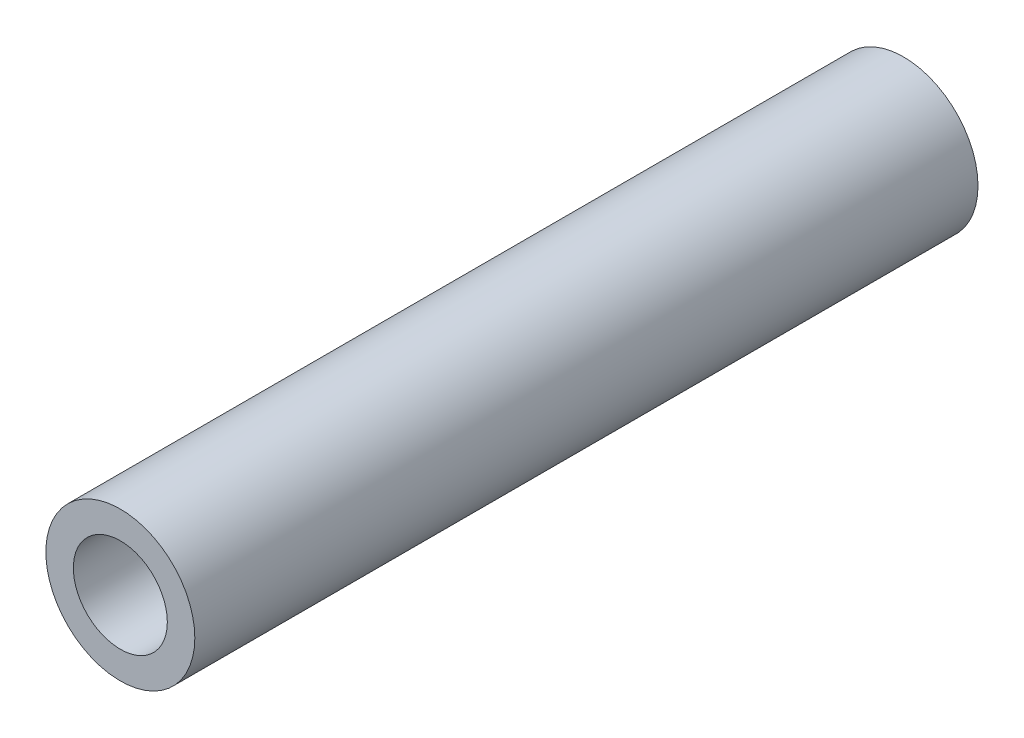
ISO-10303-21;
HEADER;
FILE_DESCRIPTION(('STEP AP214'),'2;1');
FILE_NAME('part.step','',(''),(''),'','','');
FILE_SCHEMA(('AUTOMOTIVE_DESIGN { 1 0 10303 214 1 1 1 1 }'));
ENDSEC;
DATA;
#1=APPLICATION_CONTEXT('core data for automotive mechanical design processes');
#2=APPLICATION_PROTOCOL_DEFINITION('international standard','automotive_design',2000,#1);
#3=PRODUCT_CONTEXT('',#1,'mechanical');
#4=PRODUCT('Part','Part','',(#3));
#5=PRODUCT_RELATED_PRODUCT_CATEGORY('part','',(#4));
#6=PRODUCT_DEFINITION_FORMATION('','',#4);
#7=PRODUCT_DEFINITION_CONTEXT('part definition',#1,'design');
#8=PRODUCT_DEFINITION('design','',#6,#7);
#9=PRODUCT_DEFINITION_SHAPE('','',#8);
#10=(LENGTH_UNIT() NAMED_UNIT(*) SI_UNIT(.MILLI.,.METRE.));
#11=(NAMED_UNIT(*) PLANE_ANGLE_UNIT() SI_UNIT($,.RADIAN.));
#12=(NAMED_UNIT(*) SI_UNIT($,.STERADIAN.) SOLID_ANGLE_UNIT());
#13=UNCERTAINTY_MEASURE_WITH_UNIT(LENGTH_MEASURE(1.E-05),#10,'distance_accuracy_value','');
#14=(GEOMETRIC_REPRESENTATION_CONTEXT(3) GLOBAL_UNCERTAINTY_ASSIGNED_CONTEXT((#13)) GLOBAL_UNIT_ASSIGNED_CONTEXT((#10,
#11,#12)) REPRESENTATION_CONTEXT('',''));
#15=CARTESIAN_POINT('',(0.,0.,0.));
#16=DIRECTION('',(0.,0.,1.));
#17=DIRECTION('',(1.,0.,0.));
#18=AXIS2_PLACEMENT_3D('',#15,#16,#17);
#19=CARTESIAN_POINT('',(0.,0.,250.));
#20=DIRECTION('',(0.,0.,1.));
#21=DIRECTION('',(1.,0.,0.));
#22=AXIS2_PLACEMENT_3D('',#19,#20,#21);
#23=PLANE('',#22);
#24=CARTESIAN_POINT('',(0.,0.,250.));
#25=DIRECTION('',(0.,0.,1.));
#26=DIRECTION('',(1.,0.,0.));
#27=AXIS2_PLACEMENT_3D('',#24,#25,#26);
#28=CIRCLE('',#27,23.775);
#29=CARTESIAN_POINT('',(23.775,0.,250.));
#30=VERTEX_POINT('',#29);
#31=EDGE_CURVE('E10',#30,#30,#28,.T.);
#32=ORIENTED_EDGE('',*,*,#31,.T.);
#33=EDGE_LOOP('',(#32));
#34=FACE_BOUND('',#33,.T.);
#35=CARTESIAN_POINT('',(0.,0.,250.));
#36=DIRECTION('',(0.,0.,1.));
#37=DIRECTION('',(1.,0.,0.));
#38=AXIS2_PLACEMENT_3D('',#35,#36,#37);
#39=CIRCLE('',#38,15.);
#40=CARTESIAN_POINT('',(15.,0.,250.));
#41=VERTEX_POINT('',#40);
#42=EDGE_CURVE('E46',#41,#41,#39,.T.);
#43=ORIENTED_EDGE('',*,*,#42,.F.);
#44=EDGE_LOOP('',(#43));
#45=FACE_BOUND('',#44,.T.);
#46=ADVANCED_FACE('F35',(#34,#45),#23,.T.);
#47=CARTESIAN_POINT('',(0.,0.,0.));
#48=DIRECTION('',(0.,0.,1.));
#49=DIRECTION('',(1.,0.,0.));
#50=AXIS2_PLACEMENT_3D('',#47,#48,#49);
#51=PLANE('',#50);
#52=CARTESIAN_POINT('',(0.,0.,0.));
#53=DIRECTION('',(0.,0.,1.));
#54=DIRECTION('',(1.,0.,0.));
#55=AXIS2_PLACEMENT_3D('',#52,#53,#54);
#56=CIRCLE('',#55,23.775);
#57=CARTESIAN_POINT('',(23.775,0.,0.));
#58=VERTEX_POINT('',#57);
#59=EDGE_CURVE('E39',#58,#58,#56,.T.);
#60=ORIENTED_EDGE('',*,*,#59,.F.);
#61=EDGE_LOOP('',(#60));
#62=FACE_BOUND('',#61,.T.);
#63=CARTESIAN_POINT('',(0.,0.,0.));
#64=DIRECTION('',(0.,0.,1.));
#65=DIRECTION('',(1.,0.,0.));
#66=AXIS2_PLACEMENT_3D('',#63,#64,#65);
#67=CIRCLE('',#66,15.);
#68=CARTESIAN_POINT('',(15.,0.,0.));
#69=VERTEX_POINT('',#68);
#70=EDGE_CURVE('E48',#69,#69,#67,.T.);
#71=ORIENTED_EDGE('',*,*,#70,.T.);
#72=EDGE_LOOP('',(#71));
#73=FACE_BOUND('',#72,.T.);
#74=ADVANCED_FACE('F58',(#62,#73),#51,.F.);
#75=CARTESIAN_POINT('',(0.,0.,250.));
#76=DIRECTION('',(0.,0.,-1.));
#77=DIRECTION('',(-1.,0.,0.));
#78=AXIS2_PLACEMENT_3D('',#75,#76,#77);
#79=CYLINDRICAL_SURFACE('',#78,23.775);
#80=ORIENTED_EDGE('',*,*,#31,.F.);
#81=EDGE_LOOP('',(#80));
#82=FACE_BOUND('',#81,.T.);
#83=ORIENTED_EDGE('',*,*,#59,.T.);
#84=EDGE_LOOP('',(#83));
#85=FACE_BOUND('',#84,.T.);
#86=ADVANCED_FACE('F37',(#82,#85),#79,.T.);
#87=CARTESIAN_POINT('',(0.,0.,250.));
#88=DIRECTION('',(0.,0.,-1.));
#89=DIRECTION('',(-1.,0.,0.));
#90=AXIS2_PLACEMENT_3D('',#87,#88,#89);
#91=CYLINDRICAL_SURFACE('',#90,15.);
#92=ORIENTED_EDGE('',*,*,#42,.T.);
#93=EDGE_LOOP('',(#92));
#94=FACE_BOUND('',#93,.T.);
#95=ORIENTED_EDGE('',*,*,#70,.F.);
#96=EDGE_LOOP('',(#95));
#97=FACE_BOUND('',#96,.T.);
#98=ADVANCED_FACE('F54',(#94,#97),#91,.F.);
#99=CLOSED_SHELL('',(#46,#74,#86,#98));
#100=MANIFOLD_SOLID_BREP('B2',#99);
#101=ADVANCED_BREP_SHAPE_REPRESENTATION('',(#18,#100),#14);
#102=SHAPE_DEFINITION_REPRESENTATION(#9,#101);
ENDSEC;
END-ISO-10303-21;
